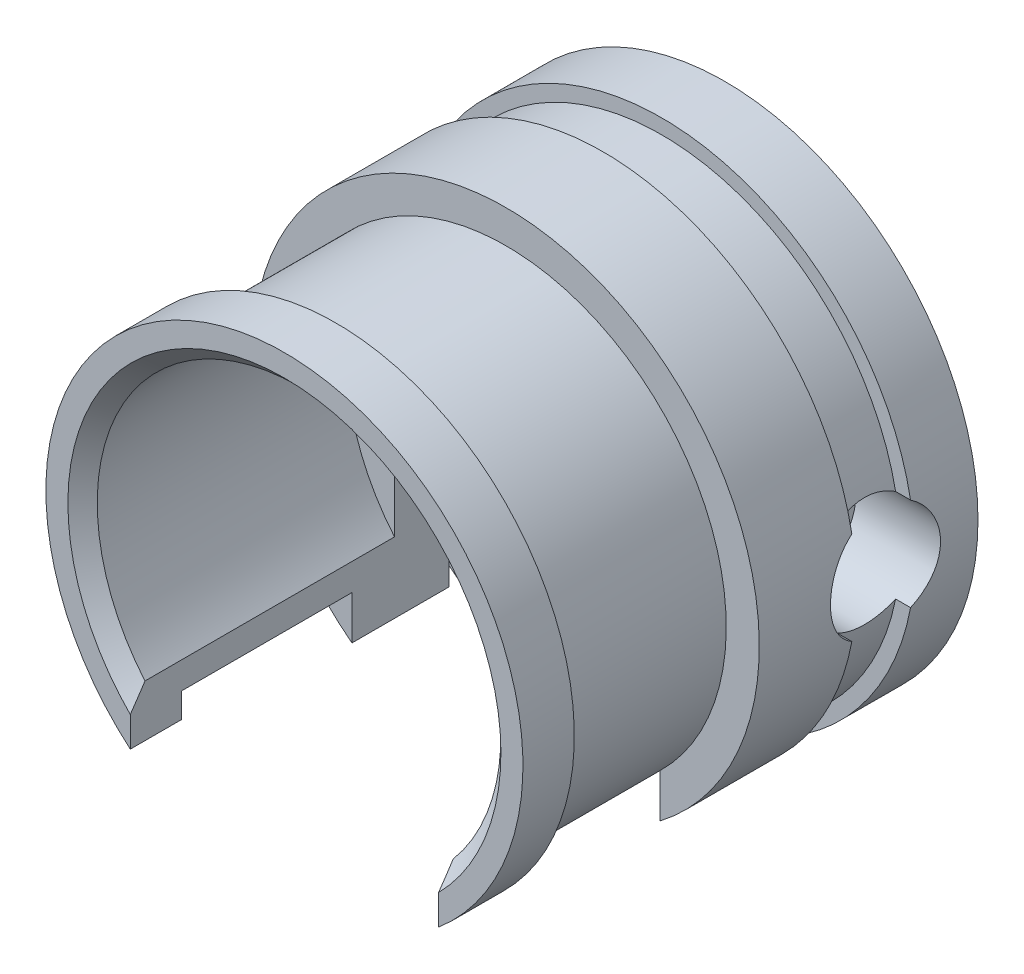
from build123d import *

# Parameters (mm, degrees)
SKETCH1_R               = 21.9075
SKETCH1_R_2             = 14.2875
BASE_EXTRUDE_DEPTH      = 38.1
SKETCH2_R               = 17.4625
CUT_EXTRUDE1_DEPTH      = 22.86
CUT_EXTRUDE2_DEPTH      = 9.2075
CUT_EXTRUDE2_DEPTH_BACK = 9.2075
SKETCH3_R               = 4.7625
CUT_EXTRUDE6_DEPTH      = 9.2075
CUT_EXTRUDE6_DEPTH_BACK = 7.62
SKETCH6_R               = 4.7625
CUT_EXTRUDE7_DEPTH      = 50.106894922
CUT_EXTRUDE7_DEPTH_BACK = 50.106894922
SKETCH7_R               = 1.2446
CUT_EXTRUDE8_REACH      = 51.107
SKETCH9_OUTSIDE_W       = 60.364
SKETCH9_OUTSIDE_H       = 60.364
SKETCH9_OUTSIDE_R       = 19.05
CUT_EXTRUDE9_DEPTH      = 14.732
CHAMFER2_SIZE           = 1.27
SKETCH10_OUTSIDE_W      = 60.364
SKETCH10_OUTSIDE_H      = 60.364
SKETCH10_OUTSIDE_R      = 20.6375
CUT_EXTRUDE10_DEPTH     = 12.7


with BuildPart() as part:
    # Sketch1 → Base-Extrude (new body)
    with BuildSketch(Plane.XY):
        with Locations(Location((0, 0, 0), (0, 0, 169.403440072))):
            Circle(SKETCH1_R)
        with Locations(Location((0, 0, 0), (0, 0, 201.039469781))):
            Circle(SKETCH1_R_2, mode=Mode.SUBTRACT)
    extrude(amount=BASE_EXTRUDE_DEPTH)

    # Sketch2 → Cut-Extrude1 (cut)
    with BuildSketch(Plane.XY.offset(38.1)):
        Circle(SKETCH2_R)
    extrude(amount=-CUT_EXTRUDE1_DEPTH, mode=Mode.SUBTRACT)

    # Sketch3 → Cut-Extrude2 (cut, two sides: drawn at the far end of the back side and taken through both)
    with BuildSketch(Plane(origin=(23.8125, 0, 0), x_dir=(0, 0, -1), z_dir=(1, 0, 0)).offset(-CUT_EXTRUDE2_DEPTH_BACK)):
        with Locations((-8.001, 0)):
            Circle(SKETCH3_R)
    extrude(amount=CUT_EXTRUDE2_DEPTH + CUT_EXTRUDE2_DEPTH_BACK, mode=Mode.SUBTRACT)

    # Sketch6 → Cut-Extrude6 (cut, two sides: drawn at the far end of the back side and taken through both)
    with BuildSketch(Plane(origin=(-23.8125, 0, 0), x_dir=(0, 0, -1), z_dir=(1, 0, 0)).offset(-CUT_EXTRUDE6_DEPTH_BACK)):
        with Locations((-8.001, 0)):
            Circle(SKETCH6_R)
    extrude(amount=CUT_EXTRUDE6_DEPTH + CUT_EXTRUDE6_DEPTH_BACK, mode=Mode.SUBTRACT)

    # Sketch7 → Cut-Extrude7 (cut, two sides: drawn at the far end of the back side and taken through both)
    with BuildSketch(Plane(origin=(0, 0, 0), x_dir=(0, 0, -1), z_dir=(1, 0, 0)).offset(-CUT_EXTRUDE7_DEPTH_BACK)):
        with Locations((-8.001, 0)):
            Circle(SKETCH7_R)
    extrude(amount=CUT_EXTRUDE7_DEPTH + CUT_EXTRUDE7_DEPTH_BACK, mode=Mode.SUBTRACT)

    # Sketch8 → Cut-Extrude8 (cut, up to next)
    with BuildSketch(Plane(origin=(0, 0, 0), x_dir=(1, 0, 0), z_dir=(0, 1, 0)), mode=Mode.PRIVATE) as cut_extrude8_sk1:
        Polygon((3.81, -38.1), (13.335, -38.1), (13.335, -10.541), (3.175, -10.541), (-3.175, -10.541), (-13.335, -10.541), (-13.335, -38.1), (-3.81, -38.1), align=None)
    cut_extrude8_tool1 = extrude(cut_extrude8_sk1.sketch, amount=-CUT_EXTRUDE8_REACH, mode=Mode.PRIVATE) & part.part
    add(cut_extrude8_tool1.solids().sort_by_distance((0, 0, 24.3205))[0], mode=Mode.SUBTRACT)

    # Sketch9 outside → Cut-Extrude9 (cut)
    with BuildSketch(Plane.XY.offset(33.655)):
        Rectangle(SKETCH9_OUTSIDE_W, SKETCH9_OUTSIDE_H)
        Circle(SKETCH9_OUTSIDE_R, mode=Mode.SUBTRACT)
    extrude(amount=-CUT_EXTRUDE9_DEPTH, mode=Mode.SUBTRACT)

    # Chamfer2
    chamfer2_edges = [part.edges().sort_by_distance(p)[0] for p in [
        (0, 17.4625, 38.1),
    ]]
    chamfer(chamfer2_edges, length=CHAMFER2_SIZE)

    # Sketch10 outside → Cut-Extrude10 (cut)
    with BuildSketch(Plane.XY.offset(38.1)):
        Rectangle(SKETCH10_OUTSIDE_W, SKETCH10_OUTSIDE_H)
        Circle(SKETCH10_OUTSIDE_R, mode=Mode.SUBTRACT)
    extrude(amount=-CUT_EXTRUDE10_DEPTH, mode=Mode.SUBTRACT)

    # Sketch12 → Cut-Revolve1 (revolve, cut)
    with BuildSketch(Plane(origin=(0, 0, 0), x_dir=(0, 0, -1), z_dir=(1, 0, 0)), mode=Mode.PRIVATE) as cut_revolve1_sk:
        Polygon((-8.001, 21.9075), (-5.461, 21.9075), (-5.461, 20.6375), (-10.541, 20.6375), (-10.541, 21.9075), align=None)
    revolve(cut_revolve1_sk.sketch.rotate(Axis((0, 0, 39.910181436), (0, 0, -1)), 280.596559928), axis=Axis((0, 0, 39.910181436), (0, 0, -1)), mode=Mode.SUBTRACT)


solid = part.part
